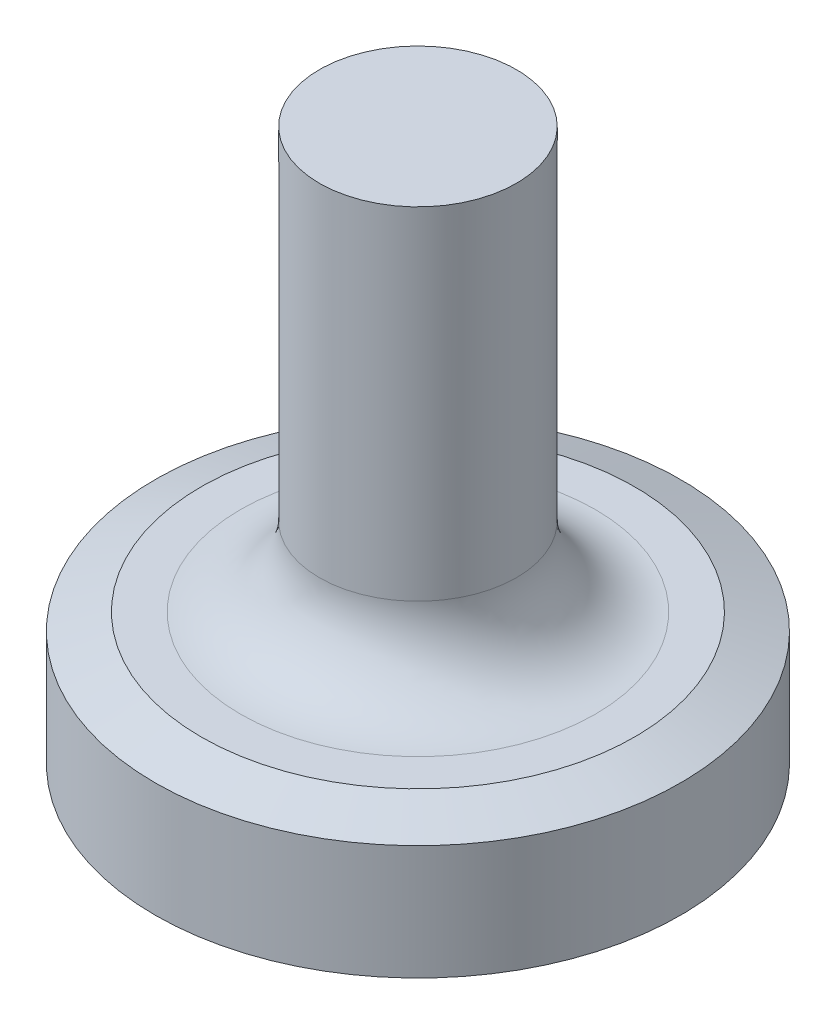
ISO-10303-21;
HEADER;
FILE_DESCRIPTION(('STEP AP214'),'2;1');
FILE_NAME('part.step','',(''),(''),'','','');
FILE_SCHEMA(('AUTOMOTIVE_DESIGN { 1 0 10303 214 1 1 1 1 }'));
ENDSEC;
DATA;
#1=APPLICATION_CONTEXT('core data for automotive mechanical design processes');
#2=APPLICATION_PROTOCOL_DEFINITION('international standard','automotive_design',2000,#1);
#3=PRODUCT_CONTEXT('',#1,'mechanical');
#4=PRODUCT('Part','Part','',(#3));
#5=PRODUCT_RELATED_PRODUCT_CATEGORY('part','',(#4));
#6=PRODUCT_DEFINITION_FORMATION('','',#4);
#7=PRODUCT_DEFINITION_CONTEXT('part definition',#1,'design');
#8=PRODUCT_DEFINITION('design','',#6,#7);
#9=PRODUCT_DEFINITION_SHAPE('','',#8);
#10=(LENGTH_UNIT() NAMED_UNIT(*) SI_UNIT(.MILLI.,.METRE.));
#11=(NAMED_UNIT(*) PLANE_ANGLE_UNIT() SI_UNIT($,.RADIAN.));
#12=(NAMED_UNIT(*) SI_UNIT($,.STERADIAN.) SOLID_ANGLE_UNIT());
#13=UNCERTAINTY_MEASURE_WITH_UNIT(LENGTH_MEASURE(1.E-05),#10,'distance_accuracy_value','');
#14=(GEOMETRIC_REPRESENTATION_CONTEXT(3) GLOBAL_UNCERTAINTY_ASSIGNED_CONTEXT((#13)) GLOBAL_UNIT_ASSIGNED_CONTEXT((#10,
#11,#12)) REPRESENTATION_CONTEXT('',''));
#15=CARTESIAN_POINT('',(0.,0.,0.));
#16=DIRECTION('',(0.,0.,1.));
#17=DIRECTION('',(1.,0.,0.));
#18=AXIS2_PLACEMENT_3D('',#15,#16,#17);
#19=CARTESIAN_POINT('',(0.,210.,0.));
#20=DIRECTION('',(0.,-1.,0.));
#21=DIRECTION('',(0.,0.,-1.));
#22=AXIS2_PLACEMENT_3D('',#19,#20,#21);
#23=PLANE('',#22);
#24=CARTESIAN_POINT('',(0.,210.,0.));
#25=DIRECTION('',(0.,1.,0.));
#26=DIRECTION('',(0.,0.,1.));
#27=AXIS2_PLACEMENT_3D('',#24,#25,#26);
#28=CIRCLE('',#27,37.5);
#29=CARTESIAN_POINT('',(0.,210.,37.5));
#30=VERTEX_POINT('',#29);
#31=EDGE_CURVE('E54',#30,#30,#28,.T.);
#32=ORIENTED_EDGE('',*,*,#31,.T.);
#33=EDGE_LOOP('',(#32));
#34=FACE_BOUND('',#33,.T.);
#35=ADVANCED_FACE('F41',(#34),#23,.F.);
#36=CARTESIAN_POINT('',(0.,124.896640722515,0.));
#37=DIRECTION('',(0.,1.,0.));
#38=DIRECTION('',(0.,0.,1.));
#39=AXIS2_PLACEMENT_3D('',#36,#37,#38);
#40=CYLINDRICAL_SURFACE('',#39,37.5);
#41=CARTESIAN_POINT('',(0.,80.,0.));
#42=DIRECTION('',(0.,-1.,0.));
#43=DIRECTION('',(0.,0.,-1.));
#44=AXIS2_PLACEMENT_3D('',#41,#42,#43);
#45=CIRCLE('',#44,37.5);
#46=CARTESIAN_POINT('',(0.,80.,-37.5));
#47=VERTEX_POINT('',#46);
#48=EDGE_CURVE('E49',#47,#47,#45,.F.);
#49=ORIENTED_EDGE('',*,*,#48,.T.);
#50=EDGE_LOOP('',(#49));
#51=FACE_BOUND('',#50,.T.);
#52=ORIENTED_EDGE('',*,*,#31,.F.);
#53=EDGE_LOOP('',(#52));
#54=FACE_BOUND('',#53,.T.);
#55=ADVANCED_FACE('F88',(#51,#54),#40,.T.);
#56=CARTESIAN_POINT('',(0.,50.,-37.5));
#57=DIRECTION('',(0.,-1.,0.));
#58=DIRECTION('',(0.,0.,-1.));
#59=AXIS2_PLACEMENT_3D('',#56,#57,#58);
#60=PLANE('',#59);
#61=CARTESIAN_POINT('',(0.,50.,0.));
#62=DIRECTION('',(0.,-1.,0.));
#63=DIRECTION('',(0.,0.,-1.));
#64=AXIS2_PLACEMENT_3D('',#61,#62,#63);
#65=CIRCLE('',#64,67.5);
#66=CARTESIAN_POINT('',(0.,50.,-67.5));
#67=VERTEX_POINT('',#66);
#68=EDGE_CURVE('E10',#67,#67,#65,.T.);
#69=ORIENTED_EDGE('',*,*,#68,.T.);
#70=EDGE_LOOP('',(#69));
#71=FACE_BOUND('',#70,.T.);
#72=CARTESIAN_POINT('',(0.,50.,0.));
#73=DIRECTION('',(0.,1.,0.));
#74=DIRECTION('',(0.,0.,1.));
#75=AXIS2_PLACEMENT_3D('',#72,#73,#74);
#76=CIRCLE('',#75,82.5);
#77=CARTESIAN_POINT('',(0.,50.,82.5));
#78=VERTEX_POINT('',#77);
#79=EDGE_CURVE('E59',#78,#78,#76,.T.);
#80=ORIENTED_EDGE('',*,*,#79,.T.);
#81=EDGE_LOOP('',(#80));
#82=FACE_BOUND('',#81,.T.);
#83=ADVANCED_FACE('F93',(#71,#82),#60,.F.);
#84=CARTESIAN_POINT('',(0.,43.6305209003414,0.));
#85=DIRECTION('',(0.,-1.,0.));
#86=DIRECTION('',(0.,0.,-1.));
#87=AXIS2_PLACEMENT_3D('',#84,#85,#86);
#88=CONICAL_SURFACE('',#87,100.,1.22173047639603);
#89=ORIENTED_EDGE('',*,*,#79,.F.);
#90=EDGE_LOOP('',(#89));
#91=FACE_BOUND('',#90,.T.);
#92=CARTESIAN_POINT('',(0.,43.6305209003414,0.));
#93=DIRECTION('',(0.,1.,0.));
#94=DIRECTION('',(0.,0.,1.));
#95=AXIS2_PLACEMENT_3D('',#92,#93,#94);
#96=CIRCLE('',#95,100.);
#97=CARTESIAN_POINT('',(0.,43.6305209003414,100.));
#98=VERTEX_POINT('',#97);
#99=EDGE_CURVE('E65',#98,#98,#96,.T.);
#100=ORIENTED_EDGE('',*,*,#99,.T.);
#101=EDGE_LOOP('',(#100));
#102=FACE_BOUND('',#101,.T.);
#103=ADVANCED_FACE('F84',(#91,#102),#88,.T.);
#104=CARTESIAN_POINT('',(0.,124.896640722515,0.));
#105=DIRECTION('',(0.,1.,0.));
#106=DIRECTION('',(0.,0.,1.));
#107=AXIS2_PLACEMENT_3D('',#104,#105,#106);
#108=CYLINDRICAL_SURFACE('',#107,100.);
#109=ORIENTED_EDGE('',*,*,#99,.F.);
#110=EDGE_LOOP('',(#109));
#111=FACE_BOUND('',#110,.T.);
#112=CARTESIAN_POINT('',(0.,0.,0.));
#113=DIRECTION('',(0.,1.,0.));
#114=DIRECTION('',(0.,0.,1.));
#115=AXIS2_PLACEMENT_3D('',#112,#113,#114);
#116=CIRCLE('',#115,100.);
#117=CARTESIAN_POINT('',(0.,0.,100.));
#118=VERTEX_POINT('',#117);
#119=EDGE_CURVE('E69',#118,#118,#116,.T.);
#120=ORIENTED_EDGE('',*,*,#119,.T.);
#121=EDGE_LOOP('',(#120));
#122=FACE_BOUND('',#121,.T.);
#123=ADVANCED_FACE('F74',(#111,#122),#108,.T.);
#124=CARTESIAN_POINT('',(0.,0.,-100.));
#125=DIRECTION('',(0.,1.,0.));
#126=DIRECTION('',(0.,0.,1.));
#127=AXIS2_PLACEMENT_3D('',#124,#125,#126);
#128=PLANE('',#127);
#129=ORIENTED_EDGE('',*,*,#119,.F.);
#130=EDGE_LOOP('',(#129));
#131=FACE_BOUND('',#130,.T.);
#132=ADVANCED_FACE('F76',(#131),#128,.F.);
#133=CARTESIAN_POINT('',(0.,80.,0.));
#134=DIRECTION('',(0.,-1.,0.));
#135=DIRECTION('',(0.,0.,-1.));
#136=AXIS2_PLACEMENT_3D('',#133,#134,#135);
#137=TOROIDAL_SURFACE('',#136,67.5,30.);
#138=ORIENTED_EDGE('',*,*,#68,.F.);
#139=EDGE_LOOP('',(#138));
#140=FACE_BOUND('',#139,.T.);
#141=ORIENTED_EDGE('',*,*,#48,.F.);
#142=EDGE_LOOP('',(#141));
#143=FACE_BOUND('',#142,.T.);
#144=ADVANCED_FACE('F43',(#140,#143),#137,.F.);
#145=CLOSED_SHELL('',(#35,#55,#83,#103,#123,#132,#144));
#146=MANIFOLD_SOLID_BREP('B2',#145);
#147=ADVANCED_BREP_SHAPE_REPRESENTATION('',(#18,#146),#14);
#148=SHAPE_DEFINITION_REPRESENTATION(#9,#147);
ENDSEC;
END-ISO-10303-21;
